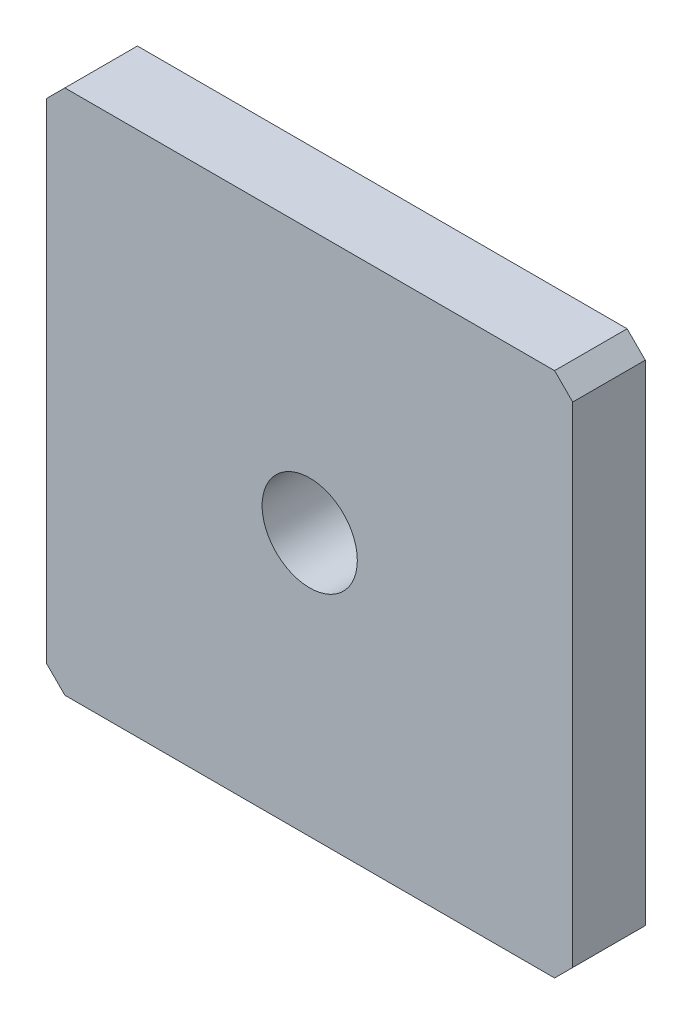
ISO-10303-21;
HEADER;
FILE_DESCRIPTION(('STEP AP214'),'2;1');
FILE_NAME('part.step','',(''),(''),'','','');
FILE_SCHEMA(('AUTOMOTIVE_DESIGN { 1 0 10303 214 1 1 1 1 }'));
ENDSEC;
DATA;
#1=APPLICATION_CONTEXT('core data for automotive mechanical design processes');
#2=APPLICATION_PROTOCOL_DEFINITION('international standard','automotive_design',2000,#1);
#3=PRODUCT_CONTEXT('',#1,'mechanical');
#4=PRODUCT('Part','Part','',(#3));
#5=PRODUCT_RELATED_PRODUCT_CATEGORY('part','',(#4));
#6=PRODUCT_DEFINITION_FORMATION('','',#4);
#7=PRODUCT_DEFINITION_CONTEXT('part definition',#1,'design');
#8=PRODUCT_DEFINITION('design','',#6,#7);
#9=PRODUCT_DEFINITION_SHAPE('','',#8);
#10=(LENGTH_UNIT() NAMED_UNIT(*) SI_UNIT(.MILLI.,.METRE.));
#11=(NAMED_UNIT(*) PLANE_ANGLE_UNIT() SI_UNIT($,.RADIAN.));
#12=(NAMED_UNIT(*) SI_UNIT($,.STERADIAN.) SOLID_ANGLE_UNIT());
#13=UNCERTAINTY_MEASURE_WITH_UNIT(LENGTH_MEASURE(1.E-05),#10,'distance_accuracy_value','');
#14=(GEOMETRIC_REPRESENTATION_CONTEXT(3) GLOBAL_UNCERTAINTY_ASSIGNED_CONTEXT((#13)) GLOBAL_UNIT_ASSIGNED_CONTEXT((#10,
#11,#12)) REPRESENTATION_CONTEXT('',''));
#15=CARTESIAN_POINT('',(0.,0.,0.));
#16=DIRECTION('',(0.,0.,1.));
#17=DIRECTION('',(1.,0.,0.));
#18=AXIS2_PLACEMENT_3D('',#15,#16,#17);
#19=CARTESIAN_POINT('',(0.,0.,8.));
#20=DIRECTION('',(1.,0.,0.));
#21=DIRECTION('',(0.,0.,-1.));
#22=AXIS2_PLACEMENT_3D('',#19,#20,#21);
#23=PLANE('',#22);
#24=DIRECTION('',(0.,-1.,0.));
#25=VECTOR('',#24,1.);
#26=CARTESIAN_POINT('',(0.,0.,0.));
#27=LINE('',#26,#25);
#28=CARTESIAN_POINT('',(0.,56.,0.));
#29=VERTEX_POINT('',#28);
#30=CARTESIAN_POINT('',(0.,2.,0.));
#31=VERTEX_POINT('',#30);
#32=EDGE_CURVE('E125',#29,#31,#27,.T.);
#33=ORIENTED_EDGE('',*,*,#32,.T.);
#34=DIRECTION('',(0.,0.,1.));
#35=VECTOR('',#34,1.);
#36=CARTESIAN_POINT('',(0.,2.,8.));
#37=LINE('',#36,#35);
#38=CARTESIAN_POINT('',(0.,2.,8.));
#39=VERTEX_POINT('',#38);
#40=EDGE_CURVE('E103',#31,#39,#37,.T.);
#41=ORIENTED_EDGE('',*,*,#40,.T.);
#42=DIRECTION('',(0.,-1.,0.));
#43=VECTOR('',#42,1.);
#44=CARTESIAN_POINT('',(0.,0.,8.));
#45=LINE('',#44,#43);
#46=CARTESIAN_POINT('',(0.,56.,8.));
#47=VERTEX_POINT('',#46);
#48=EDGE_CURVE('E135',#47,#39,#45,.T.);
#49=ORIENTED_EDGE('',*,*,#48,.F.);
#50=DIRECTION('',(0.,0.,-1.));
#51=VECTOR('',#50,1.);
#52=CARTESIAN_POINT('',(0.,56.,8.));
#53=LINE('',#52,#51);
#54=EDGE_CURVE('E108',#47,#29,#53,.T.);
#55=ORIENTED_EDGE('',*,*,#54,.T.);
#56=EDGE_LOOP('',(#33,#41,#49,#55));
#57=FACE_BOUND('',#56,.T.);
#58=ADVANCED_FACE('F32',(#57),#23,.F.);
#59=CARTESIAN_POINT('',(0.,0.,8.));
#60=DIRECTION('',(0.,1.,0.));
#61=DIRECTION('',(0.,0.,1.));
#62=AXIS2_PLACEMENT_3D('',#59,#60,#61);
#63=PLANE('',#62);
#64=DIRECTION('',(1.,0.,0.));
#65=VECTOR('',#64,1.);
#66=CARTESIAN_POINT('',(0.,0.,8.));
#67=LINE('',#66,#65);
#68=CARTESIAN_POINT('',(1.99999999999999,0.,8.));
#69=VERTEX_POINT('',#68);
#70=CARTESIAN_POINT('',(56.,0.,8.));
#71=VERTEX_POINT('',#70);
#72=EDGE_CURVE('E118',#69,#71,#67,.T.);
#73=ORIENTED_EDGE('',*,*,#72,.F.);
#74=DIRECTION('',(0.,0.,-1.));
#75=VECTOR('',#74,1.);
#76=CARTESIAN_POINT('',(1.99999999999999,0.,8.));
#77=LINE('',#76,#75);
#78=CARTESIAN_POINT('',(2.,0.,0.));
#79=VERTEX_POINT('',#78);
#80=EDGE_CURVE('E102',#69,#79,#77,.T.);
#81=ORIENTED_EDGE('',*,*,#80,.T.);
#82=DIRECTION('',(1.,0.,0.));
#83=VECTOR('',#82,1.);
#84=CARTESIAN_POINT('',(0.,0.,0.));
#85=LINE('',#84,#83);
#86=CARTESIAN_POINT('',(56.,0.,0.));
#87=VERTEX_POINT('',#86);
#88=EDGE_CURVE('E115',#79,#87,#85,.T.);
#89=ORIENTED_EDGE('',*,*,#88,.T.);
#90=DIRECTION('',(0.,0.,1.));
#91=VECTOR('',#90,1.);
#92=CARTESIAN_POINT('',(56.,0.,8.));
#93=LINE('',#92,#91);
#94=EDGE_CURVE('E120',#87,#71,#93,.T.);
#95=ORIENTED_EDGE('',*,*,#94,.T.);
#96=EDGE_LOOP('',(#73,#81,#89,#95));
#97=FACE_BOUND('',#96,.T.);
#98=ADVANCED_FACE('F114',(#97),#63,.F.);
#99=CARTESIAN_POINT('',(58.,0.,8.));
#100=DIRECTION('',(-1.,0.,0.));
#101=DIRECTION('',(0.,0.,1.));
#102=AXIS2_PLACEMENT_3D('',#99,#100,#101);
#103=PLANE('',#102);
#104=DIRECTION('',(0.,1.,0.));
#105=VECTOR('',#104,1.);
#106=CARTESIAN_POINT('',(58.,0.,8.));
#107=LINE('',#106,#105);
#108=CARTESIAN_POINT('',(58.,1.99999999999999,8.));
#109=VERTEX_POINT('',#108);
#110=CARTESIAN_POINT('',(58.,56.,8.));
#111=VERTEX_POINT('',#110);
#112=EDGE_CURVE('E161',#109,#111,#107,.T.);
#113=ORIENTED_EDGE('',*,*,#112,.F.);
#114=DIRECTION('',(0.,0.,-1.));
#115=VECTOR('',#114,1.);
#116=CARTESIAN_POINT('',(58.,1.99999999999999,8.));
#117=LINE('',#116,#115);
#118=CARTESIAN_POINT('',(58.,1.99999999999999,0.));
#119=VERTEX_POINT('',#118);
#120=EDGE_CURVE('E154',#109,#119,#117,.T.);
#121=ORIENTED_EDGE('',*,*,#120,.T.);
#122=DIRECTION('',(0.,1.,0.));
#123=VECTOR('',#122,1.);
#124=CARTESIAN_POINT('',(58.,0.,0.));
#125=LINE('',#124,#123);
#126=CARTESIAN_POINT('',(58.,56.,0.));
#127=VERTEX_POINT('',#126);
#128=EDGE_CURVE('E124',#119,#127,#125,.T.);
#129=ORIENTED_EDGE('',*,*,#128,.T.);
#130=DIRECTION('',(0.,0.,1.));
#131=VECTOR('',#130,1.);
#132=CARTESIAN_POINT('',(58.,56.,8.));
#133=LINE('',#132,#131);
#134=EDGE_CURVE('E152',#127,#111,#133,.T.);
#135=ORIENTED_EDGE('',*,*,#134,.T.);
#136=EDGE_LOOP('',(#113,#121,#129,#135));
#137=FACE_BOUND('',#136,.T.);
#138=ADVANCED_FACE('F159',(#137),#103,.F.);
#139=CARTESIAN_POINT('',(0.,58.,8.));
#140=DIRECTION('',(0.,-1.,0.));
#141=DIRECTION('',(0.,0.,-1.));
#142=AXIS2_PLACEMENT_3D('',#139,#140,#141);
#143=PLANE('',#142);
#144=DIRECTION('',(-1.,0.,0.));
#145=VECTOR('',#144,1.);
#146=CARTESIAN_POINT('',(0.,58.,8.));
#147=LINE('',#146,#145);
#148=CARTESIAN_POINT('',(56.,58.,8.));
#149=VERTEX_POINT('',#148);
#150=CARTESIAN_POINT('',(2.,58.,8.));
#151=VERTEX_POINT('',#150);
#152=EDGE_CURVE('E136',#149,#151,#147,.T.);
#153=ORIENTED_EDGE('',*,*,#152,.F.);
#154=DIRECTION('',(0.,0.,-1.));
#155=VECTOR('',#154,1.);
#156=CARTESIAN_POINT('',(56.,58.,8.));
#157=LINE('',#156,#155);
#158=CARTESIAN_POINT('',(56.,58.,0.));
#159=VERTEX_POINT('',#158);
#160=EDGE_CURVE('E11',#149,#159,#157,.T.);
#161=ORIENTED_EDGE('',*,*,#160,.T.);
#162=DIRECTION('',(-1.,0.,0.));
#163=VECTOR('',#162,1.);
#164=CARTESIAN_POINT('',(0.,58.,0.));
#165=LINE('',#164,#163);
#166=CARTESIAN_POINT('',(2.,58.,0.));
#167=VERTEX_POINT('',#166);
#168=EDGE_CURVE('E128',#159,#167,#165,.T.);
#169=ORIENTED_EDGE('',*,*,#168,.T.);
#170=DIRECTION('',(0.,0.,1.));
#171=VECTOR('',#170,1.);
#172=CARTESIAN_POINT('',(2.,58.,8.));
#173=LINE('',#172,#171);
#174=EDGE_CURVE('E40',#167,#151,#173,.T.);
#175=ORIENTED_EDGE('',*,*,#174,.T.);
#176=EDGE_LOOP('',(#153,#161,#169,#175));
#177=FACE_BOUND('',#176,.T.);
#178=ADVANCED_FACE('F168',(#177),#143,.F.);
#179=CARTESIAN_POINT('',(0.,58.,8.));
#180=DIRECTION('',(0.,0.,-1.));
#181=DIRECTION('',(-1.,0.,0.));
#182=AXIS2_PLACEMENT_3D('',#179,#180,#181);
#183=PLANE('',#182);
#184=CARTESIAN_POINT('',(29.,29.,8.));
#185=DIRECTION('',(0.,0.,1.));
#186=DIRECTION('',(1.,0.,0.));
#187=AXIS2_PLACEMENT_3D('',#184,#185,#186);
#188=CIRCLE('',#187,5.24999999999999);
#189=CARTESIAN_POINT('',(34.25,29.,8.));
#190=VERTEX_POINT('',#189);
#191=EDGE_CURVE('E177',#190,#190,#188,.T.);
#192=ORIENTED_EDGE('',*,*,#191,.F.);
#193=EDGE_LOOP('',(#192));
#194=FACE_BOUND('',#193,.T.);
#195=ORIENTED_EDGE('',*,*,#48,.T.);
#196=DIRECTION('',(-0.707106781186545,0.70710678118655,0.));
#197=VECTOR('',#196,1.);
#198=CARTESIAN_POINT('',(1.99999999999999,0.,8.));
#199=LINE('',#198,#197);
#200=EDGE_CURVE('E150',#39,#69,#199,.F.);
#201=ORIENTED_EDGE('',*,*,#200,.T.);
#202=ORIENTED_EDGE('',*,*,#72,.T.);
#203=DIRECTION('',(-0.70710678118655,-0.707106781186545,0.));
#204=VECTOR('',#203,1.);
#205=CARTESIAN_POINT('',(58.,1.99999999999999,8.));
#206=LINE('',#205,#204);
#207=EDGE_CURVE('E148',#71,#109,#206,.F.);
#208=ORIENTED_EDGE('',*,*,#207,.T.);
#209=ORIENTED_EDGE('',*,*,#112,.T.);
#210=DIRECTION('',(0.707106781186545,-0.70710678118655,0.));
#211=VECTOR('',#210,1.);
#212=CARTESIAN_POINT('',(56.,58.,8.));
#213=LINE('',#212,#211);
#214=EDGE_CURVE('E53',#111,#149,#213,.F.);
#215=ORIENTED_EDGE('',*,*,#214,.T.);
#216=ORIENTED_EDGE('',*,*,#152,.T.);
#217=DIRECTION('',(0.70710678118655,0.707106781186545,0.));
#218=VECTOR('',#217,1.);
#219=CARTESIAN_POINT('',(0.,56.,8.));
#220=LINE('',#219,#218);
#221=EDGE_CURVE('E145',#151,#47,#220,.F.);
#222=ORIENTED_EDGE('',*,*,#221,.T.);
#223=EDGE_LOOP('',(#195,#201,#202,#208,#209,#215,#216,#222));
#224=FACE_BOUND('',#223,.T.);
#225=ADVANCED_FACE('F183',(#194,#224),#183,.F.);
#226=CARTESIAN_POINT('',(0.,58.,0.));
#227=DIRECTION('',(0.,0.,-1.));
#228=DIRECTION('',(-1.,0.,0.));
#229=AXIS2_PLACEMENT_3D('',#226,#227,#228);
#230=PLANE('',#229);
#231=CARTESIAN_POINT('',(29.,29.,0.));
#232=DIRECTION('',(0.,0.,1.));
#233=DIRECTION('',(1.,0.,0.));
#234=AXIS2_PLACEMENT_3D('',#231,#232,#233);
#235=CIRCLE('',#234,5.25);
#236=CARTESIAN_POINT('',(34.25,29.,0.));
#237=VERTEX_POINT('',#236);
#238=EDGE_CURVE('E130',#237,#237,#235,.T.);
#239=ORIENTED_EDGE('',*,*,#238,.T.);
#240=EDGE_LOOP('',(#239));
#241=FACE_BOUND('',#240,.T.);
#242=ORIENTED_EDGE('',*,*,#88,.F.);
#243=DIRECTION('',(0.707106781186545,-0.70710678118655,0.));
#244=VECTOR('',#243,1.);
#245=CARTESIAN_POINT('',(-28.,30.0000000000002,0.));
#246=LINE('',#245,#244);
#247=EDGE_CURVE('E98',#79,#31,#246,.F.);
#248=ORIENTED_EDGE('',*,*,#247,.T.);
#249=ORIENTED_EDGE('',*,*,#32,.F.);
#250=DIRECTION('',(-0.70710678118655,-0.707106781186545,0.));
#251=VECTOR('',#250,1.);
#252=CARTESIAN_POINT('',(0.999999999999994,57.,0.));
#253=LINE('',#252,#251);
#254=EDGE_CURVE('E119',#29,#167,#253,.F.);
#255=ORIENTED_EDGE('',*,*,#254,.T.);
#256=ORIENTED_EDGE('',*,*,#168,.F.);
#257=DIRECTION('',(-0.707106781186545,0.70710678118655,0.));
#258=VECTOR('',#257,1.);
#259=CARTESIAN_POINT('',(28.0000000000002,86.,0.));
#260=LINE('',#259,#258);
#261=EDGE_CURVE('E139',#159,#127,#260,.F.);
#262=ORIENTED_EDGE('',*,*,#261,.T.);
#263=ORIENTED_EDGE('',*,*,#128,.F.);
#264=DIRECTION('',(0.70710678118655,0.707106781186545,0.));
#265=VECTOR('',#264,1.);
#266=CARTESIAN_POINT('',(56.9999999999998,0.9999999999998,0.));
#267=LINE('',#266,#265);
#268=EDGE_CURVE('E109',#119,#87,#267,.F.);
#269=ORIENTED_EDGE('',*,*,#268,.T.);
#270=EDGE_LOOP('',(#242,#248,#249,#255,#256,#262,#263,#269));
#271=FACE_BOUND('',#270,.T.);
#272=ADVANCED_FACE('F122',(#241,#271),#230,.T.);
#273=CARTESIAN_POINT('',(29.,29.,8.));
#274=DIRECTION('',(0.,0.,1.));
#275=DIRECTION('',(1.,0.,0.));
#276=AXIS2_PLACEMENT_3D('',#273,#274,#275);
#277=CYLINDRICAL_SURFACE('',#276,5.24999999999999);
#278=ORIENTED_EDGE('',*,*,#238,.F.);
#279=EDGE_LOOP('',(#278));
#280=FACE_BOUND('',#279,.T.);
#281=ORIENTED_EDGE('',*,*,#191,.T.);
#282=EDGE_LOOP('',(#281));
#283=FACE_BOUND('',#282,.T.);
#284=ADVANCED_FACE('F181',(#280,#283),#277,.F.);
#285=CARTESIAN_POINT('',(1.99999999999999,0.,8.));
#286=DIRECTION('',(0.70710678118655,0.707106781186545,0.));
#287=DIRECTION('',(-0.707106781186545,0.70710678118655,0.));
#288=AXIS2_PLACEMENT_3D('',#285,#286,#287);
#289=PLANE('',#288);
#290=ORIENTED_EDGE('',*,*,#200,.F.);
#291=ORIENTED_EDGE('',*,*,#40,.F.);
#292=ORIENTED_EDGE('',*,*,#247,.F.);
#293=ORIENTED_EDGE('',*,*,#80,.F.);
#294=EDGE_LOOP('',(#290,#291,#292,#293));
#295=FACE_BOUND('',#294,.T.);
#296=ADVANCED_FACE('F101',(#295),#289,.F.);
#297=CARTESIAN_POINT('',(58.,1.99999999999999,8.));
#298=DIRECTION('',(-0.707106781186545,0.70710678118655,0.));
#299=DIRECTION('',(-0.70710678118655,-0.707106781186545,0.));
#300=AXIS2_PLACEMENT_3D('',#297,#298,#299);
#301=PLANE('',#300);
#302=ORIENTED_EDGE('',*,*,#207,.F.);
#303=ORIENTED_EDGE('',*,*,#94,.F.);
#304=ORIENTED_EDGE('',*,*,#268,.F.);
#305=ORIENTED_EDGE('',*,*,#120,.F.);
#306=EDGE_LOOP('',(#302,#303,#304,#305));
#307=FACE_BOUND('',#306,.T.);
#308=ADVANCED_FACE('F194',(#307),#301,.F.);
#309=CARTESIAN_POINT('',(56.,58.,8.));
#310=DIRECTION('',(-0.70710678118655,-0.707106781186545,0.));
#311=DIRECTION('',(0.707106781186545,-0.70710678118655,0.));
#312=AXIS2_PLACEMENT_3D('',#309,#310,#311);
#313=PLANE('',#312);
#314=ORIENTED_EDGE('',*,*,#214,.F.);
#315=ORIENTED_EDGE('',*,*,#134,.F.);
#316=ORIENTED_EDGE('',*,*,#261,.F.);
#317=ORIENTED_EDGE('',*,*,#160,.F.);
#318=EDGE_LOOP('',(#314,#315,#316,#317));
#319=FACE_BOUND('',#318,.T.);
#320=ADVANCED_FACE('F167',(#319),#313,.F.);
#321=CARTESIAN_POINT('',(0.,56.,8.));
#322=DIRECTION('',(0.707106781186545,-0.70710678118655,0.));
#323=DIRECTION('',(0.70710678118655,0.707106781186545,0.));
#324=AXIS2_PLACEMENT_3D('',#321,#322,#323);
#325=PLANE('',#324);
#326=ORIENTED_EDGE('',*,*,#221,.F.);
#327=ORIENTED_EDGE('',*,*,#174,.F.);
#328=ORIENTED_EDGE('',*,*,#254,.F.);
#329=ORIENTED_EDGE('',*,*,#54,.F.);
#330=EDGE_LOOP('',(#326,#327,#328,#329));
#331=FACE_BOUND('',#330,.T.);
#332=ADVANCED_FACE('F34',(#331),#325,.F.);
#333=CLOSED_SHELL('',(#58,#98,#138,#178,#225,#272,#284,#296,#308,#320,#332));
#334=MANIFOLD_SOLID_BREP('B2',#333);
#335=ADVANCED_BREP_SHAPE_REPRESENTATION('',(#18,#334),#14);
#336=SHAPE_DEFINITION_REPRESENTATION(#9,#335);
ENDSEC;
END-ISO-10303-21;
